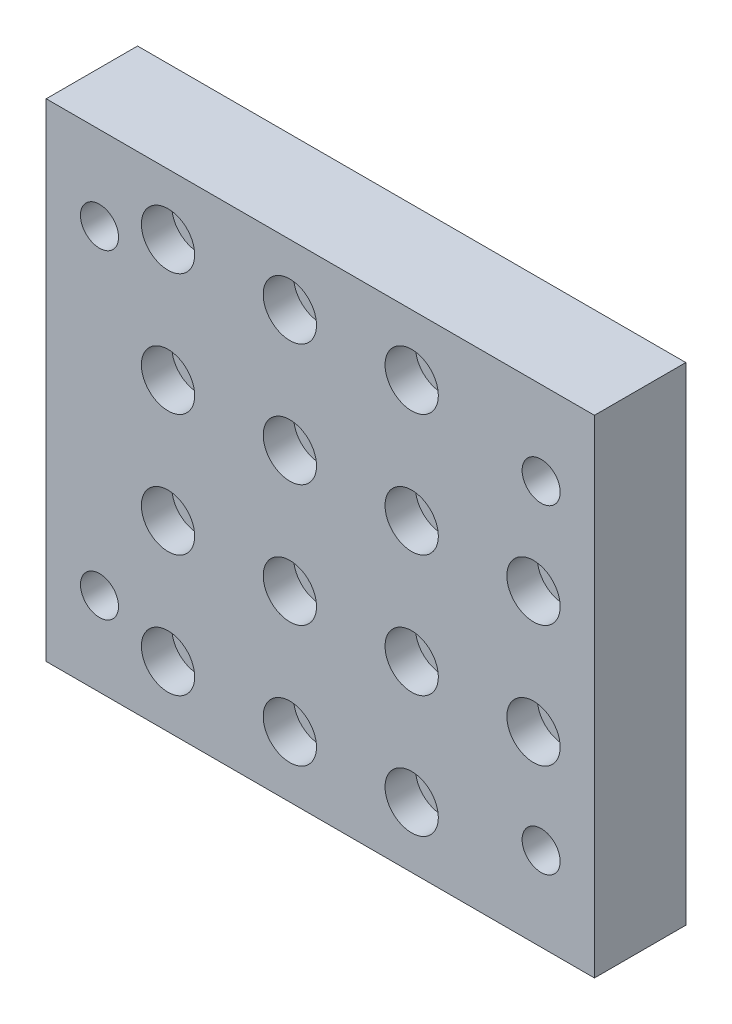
from build123d import *

# Parameters (mm, degrees)
SKETCH1_W                                        = 114.3
SKETCH1_H                                        = 101.6
BOSS_EXTRUDE1_DEPTH                              = 19.05
F_3_8_16_TAPPED_HOLE1_D                          = 7.9375
CBORE_FOR_1_4_SOCKET_HEAD_CAP_SCREW1_D           = 6.5278
CBORE_FOR_1_4_SOCKET_HEAD_CAP_SCREW1_CBORE_D     = 11.1125
CBORE_FOR_1_4_SOCKET_HEAD_CAP_SCREW1_CBORE_DEPTH = 6.35


with BuildPart() as part:
    # Sketch1 → Boss-Extrude1 (new body)
    with BuildSketch(Plane.XY.offset(19.05)):
        Rectangle(SKETCH1_W, SKETCH1_H)
    extrude(amount=-BOSS_EXTRUDE1_DEPTH)

    # 3_8-16 Tapped Hole1 (through all)
    with Locations(Plane.XY.offset(19.05)):
        with Locations((-46.0375, 33.3375), (46.0375, 33.3375), (46.0375, -33.3375), (-46.0375, -33.3375)):
            Hole(F_3_8_16_TAPPED_HOLE1_D / 2)

    # CBORE for 1_4 Socket Head Cap Screw1 (through all)
    with Locations(Plane.XY.offset(19.05)):
        with Locations((-31.75, 38.1), (-6.35, 38.1), (19.05, 38.1), (-31.75, 12.7), (-6.35, 12.7), (19.05, 12.7), (-31.75, -12.7), (-6.35, -12.7), (-31.75, -38.1), (-6.35, -38.1), (44.45, 12.7), (19.05, -12.7), (44.45, -12.7), (19.05, -38.1)):
            CounterBoreHole(CBORE_FOR_1_4_SOCKET_HEAD_CAP_SCREW1_D / 2, CBORE_FOR_1_4_SOCKET_HEAD_CAP_SCREW1_CBORE_D / 2, CBORE_FOR_1_4_SOCKET_HEAD_CAP_SCREW1_CBORE_DEPTH)


solid = part.part
